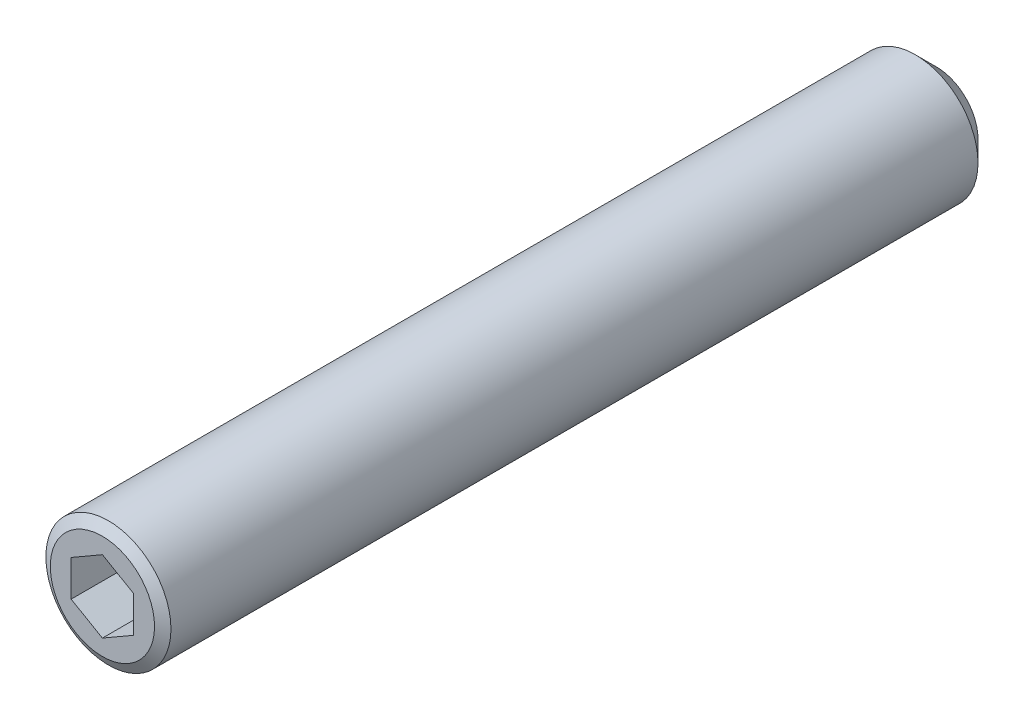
ISO-10303-21;
HEADER;
FILE_DESCRIPTION(('STEP AP214'),'2;1');
FILE_NAME('part.step','',(''),(''),'','','');
FILE_SCHEMA(('AUTOMOTIVE_DESIGN { 1 0 10303 214 1 1 1 1 }'));
ENDSEC;
DATA;
#1=APPLICATION_CONTEXT('core data for automotive mechanical design processes');
#2=APPLICATION_PROTOCOL_DEFINITION('international standard','automotive_design',2000,#1);
#3=PRODUCT_CONTEXT('',#1,'mechanical');
#4=PRODUCT('Part','Part','',(#3));
#5=PRODUCT_RELATED_PRODUCT_CATEGORY('part','',(#4));
#6=PRODUCT_DEFINITION_FORMATION('','',#4);
#7=PRODUCT_DEFINITION_CONTEXT('part definition',#1,'design');
#8=PRODUCT_DEFINITION('design','',#6,#7);
#9=PRODUCT_DEFINITION_SHAPE('','',#8);
#10=(LENGTH_UNIT() NAMED_UNIT(*) SI_UNIT(.MILLI.,.METRE.));
#11=(NAMED_UNIT(*) PLANE_ANGLE_UNIT() SI_UNIT($,.RADIAN.));
#12=(NAMED_UNIT(*) SI_UNIT($,.STERADIAN.) SOLID_ANGLE_UNIT());
#13=UNCERTAINTY_MEASURE_WITH_UNIT(LENGTH_MEASURE(1.E-05),#10,'distance_accuracy_value','');
#14=(GEOMETRIC_REPRESENTATION_CONTEXT(3) GLOBAL_UNCERTAINTY_ASSIGNED_CONTEXT((#13)) GLOBAL_UNIT_ASSIGNED_CONTEXT((#10,
#11,#12)) REPRESENTATION_CONTEXT('',''));
#15=CARTESIAN_POINT('',(0.,0.,0.));
#16=DIRECTION('',(0.,0.,1.));
#17=DIRECTION('',(1.,0.,0.));
#18=AXIS2_PLACEMENT_3D('',#15,#16,#17);
#19=CARTESIAN_POINT('',(0.,0.,40.));
#20=DIRECTION('',(0.,0.,-1.));
#21=DIRECTION('',(-1.,0.,0.));
#22=AXIS2_PLACEMENT_3D('',#19,#20,#21);
#23=CYLINDRICAL_SURFACE('',#22,3.);
#24=CARTESIAN_POINT('',(0.,0.,39.7113248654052));
#25=DIRECTION('',(0.,0.,1.));
#26=DIRECTION('',(1.,0.,0.));
#27=AXIS2_PLACEMENT_3D('',#24,#25,#26);
#28=CIRCLE('',#27,3.);
#29=CARTESIAN_POINT('',(3.,0.,39.7113248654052));
#30=VERTEX_POINT('',#29);
#31=EDGE_CURVE('E9',#30,#30,#28,.F.);
#32=ORIENTED_EDGE('',*,*,#31,.T.);
#33=EDGE_LOOP('',(#32));
#34=FACE_BOUND('',#33,.T.);
#35=CARTESIAN_POINT('',(0.,0.,1.));
#36=DIRECTION('',(0.,0.,1.));
#37=DIRECTION('',(1.,0.,0.));
#38=AXIS2_PLACEMENT_3D('',#35,#36,#37);
#39=CIRCLE('',#38,3.);
#40=CARTESIAN_POINT('',(3.,0.,1.));
#41=VERTEX_POINT('',#40);
#42=EDGE_CURVE('E116',#41,#41,#39,.T.);
#43=ORIENTED_EDGE('',*,*,#42,.T.);
#44=EDGE_LOOP('',(#43));
#45=FACE_BOUND('',#44,.T.);
#46=ADVANCED_FACE('F14',(#34,#45),#23,.T.);
#47=CARTESIAN_POINT('',(0.,0.,40.));
#48=DIRECTION('',(0.,0.,1.));
#49=DIRECTION('',(1.,0.,0.));
#50=AXIS2_PLACEMENT_3D('',#47,#48,#49);
#51=PLANE('',#50);
#52=DIRECTION('',(-0.866025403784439,0.5,0.));
#53=VECTOR('',#52,1.);
#54=CARTESIAN_POINT('',(1.5,0.866025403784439,40.));
#55=LINE('',#54,#53);
#56=CARTESIAN_POINT('',(1.5,0.866025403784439,40.));
#57=VERTEX_POINT('',#56);
#58=CARTESIAN_POINT('',(0.,1.73205080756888,40.));
#59=VERTEX_POINT('',#58);
#60=EDGE_CURVE('E29',#57,#59,#55,.T.);
#61=ORIENTED_EDGE('',*,*,#60,.F.);
#62=DIRECTION('',(0.,1.,0.));
#63=VECTOR('',#62,1.);
#64=CARTESIAN_POINT('',(1.5,-0.866025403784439,40.));
#65=LINE('',#64,#63);
#66=CARTESIAN_POINT('',(1.5,-0.866025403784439,40.));
#67=VERTEX_POINT('',#66);
#68=EDGE_CURVE('E112',#67,#57,#65,.T.);
#69=ORIENTED_EDGE('',*,*,#68,.F.);
#70=DIRECTION('',(0.866025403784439,0.5,0.));
#71=VECTOR('',#70,1.);
#72=CARTESIAN_POINT('',(0.,-1.73205080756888,40.));
#73=LINE('',#72,#71);
#74=CARTESIAN_POINT('',(0.,-1.73205080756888,40.));
#75=VERTEX_POINT('',#74);
#76=EDGE_CURVE('E110',#75,#67,#73,.T.);
#77=ORIENTED_EDGE('',*,*,#76,.F.);
#78=DIRECTION('',(0.866025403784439,-0.5,0.));
#79=VECTOR('',#78,1.);
#80=CARTESIAN_POINT('',(-1.5,-0.866025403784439,40.));
#81=LINE('',#80,#79);
#82=CARTESIAN_POINT('',(-1.5,-0.866025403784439,40.));
#83=VERTEX_POINT('',#82);
#84=EDGE_CURVE('E77',#83,#75,#81,.T.);
#85=ORIENTED_EDGE('',*,*,#84,.F.);
#86=DIRECTION('',(0.,-1.,0.));
#87=VECTOR('',#86,1.);
#88=CARTESIAN_POINT('',(-1.5,0.866025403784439,40.));
#89=LINE('',#88,#87);
#90=CARTESIAN_POINT('',(-1.5,0.866025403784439,40.));
#91=VERTEX_POINT('',#90);
#92=EDGE_CURVE('E106',#91,#83,#89,.T.);
#93=ORIENTED_EDGE('',*,*,#92,.F.);
#94=DIRECTION('',(-0.866025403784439,-0.5,0.));
#95=VECTOR('',#94,1.);
#96=CARTESIAN_POINT('',(0.,1.73205080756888,40.));
#97=LINE('',#96,#95);
#98=EDGE_CURVE('E103',#59,#91,#97,.T.);
#99=ORIENTED_EDGE('',*,*,#98,.F.);
#100=EDGE_LOOP('',(#61,#69,#77,#85,#93,#99));
#101=FACE_BOUND('',#100,.T.);
#102=CARTESIAN_POINT('',(0.,0.,40.));
#103=DIRECTION('',(0.,0.,1.));
#104=DIRECTION('',(1.,0.,0.));
#105=AXIS2_PLACEMENT_3D('',#102,#103,#104);
#106=CIRCLE('',#105,2.5);
#107=CARTESIAN_POINT('',(2.5,0.,40.));
#108=VERTEX_POINT('',#107);
#109=EDGE_CURVE('E22',#108,#108,#106,.T.);
#110=ORIENTED_EDGE('',*,*,#109,.T.);
#111=EDGE_LOOP('',(#110));
#112=FACE_BOUND('',#111,.T.);
#113=ADVANCED_FACE('F129',(#101,#112),#51,.T.);
#114=CARTESIAN_POINT('',(0.,0.,0.));
#115=DIRECTION('',(0.,0.,1.));
#116=DIRECTION('',(1.,0.,0.));
#117=AXIS2_PLACEMENT_3D('',#114,#115,#116);
#118=PLANE('',#117);
#119=CARTESIAN_POINT('',(0.,0.,0.));
#120=DIRECTION('',(0.,0.,1.));
#121=DIRECTION('',(1.,0.,0.));
#122=AXIS2_PLACEMENT_3D('',#119,#120,#121);
#123=CIRCLE('',#122,2.);
#124=CARTESIAN_POINT('',(2.,0.,0.));
#125=VERTEX_POINT('',#124);
#126=EDGE_CURVE('E124',#125,#125,#123,.F.);
#127=ORIENTED_EDGE('',*,*,#126,.T.);
#128=EDGE_LOOP('',(#127));
#129=FACE_BOUND('',#128,.T.);
#130=ADVANCED_FACE('F143',(#129),#118,.F.);
#131=CARTESIAN_POINT('',(0.,0.,1.));
#132=DIRECTION('',(0.,0.,1.));
#133=DIRECTION('',(1.,0.,0.));
#134=AXIS2_PLACEMENT_3D('',#131,#132,#133);
#135=CONICAL_SURFACE('',#134,3.,0.785398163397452);
#136=ORIENTED_EDGE('',*,*,#126,.F.);
#137=EDGE_LOOP('',(#136));
#138=FACE_BOUND('',#137,.T.);
#139=ORIENTED_EDGE('',*,*,#42,.F.);
#140=EDGE_LOOP('',(#139));
#141=FACE_BOUND('',#140,.T.);
#142=ADVANCED_FACE('F133',(#138,#141),#135,.T.);
#143=CARTESIAN_POINT('',(0.,0.,40.));
#144=DIRECTION('',(0.,0.,-1.));
#145=DIRECTION('',(-1.,0.,0.));
#146=AXIS2_PLACEMENT_3D('',#143,#144,#145);
#147=CONICAL_SURFACE('',#146,2.5,1.04719755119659);
#148=ORIENTED_EDGE('',*,*,#31,.F.);
#149=EDGE_LOOP('',(#148));
#150=FACE_BOUND('',#149,.T.);
#151=ORIENTED_EDGE('',*,*,#109,.F.);
#152=EDGE_LOOP('',(#151));
#153=FACE_BOUND('',#152,.T.);
#154=ADVANCED_FACE('F16',(#150,#153),#147,.T.);
#155=CARTESIAN_POINT('',(1.5,0.866025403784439,36.5));
#156=DIRECTION('',(0.5,0.866025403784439,0.));
#157=DIRECTION('',(-0.866025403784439,0.5,0.));
#158=AXIS2_PLACEMENT_3D('',#155,#156,#157);
#159=PLANE('',#158);
#160=ORIENTED_EDGE('',*,*,#60,.T.);
#161=DIRECTION('',(0.,0.,1.));
#162=VECTOR('',#161,1.);
#163=CARTESIAN_POINT('',(0.,1.73205080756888,36.5));
#164=LINE('',#163,#162);
#165=CARTESIAN_POINT('',(0.,1.73205080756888,36.5));
#166=VERTEX_POINT('',#165);
#167=EDGE_CURVE('E59',#166,#59,#164,.T.);
#168=ORIENTED_EDGE('',*,*,#167,.F.);
#169=DIRECTION('',(-0.866025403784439,0.5,0.));
#170=VECTOR('',#169,1.);
#171=CARTESIAN_POINT('',(1.5,0.866025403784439,36.5));
#172=LINE('',#171,#170);
#173=CARTESIAN_POINT('',(1.5,0.866025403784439,36.5));
#174=VERTEX_POINT('',#173);
#175=EDGE_CURVE('E114',#174,#166,#172,.T.);
#176=ORIENTED_EDGE('',*,*,#175,.F.);
#177=DIRECTION('',(0.,0.,1.));
#178=VECTOR('',#177,1.);
#179=CARTESIAN_POINT('',(1.5,0.866025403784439,36.5));
#180=LINE('',#179,#178);
#181=EDGE_CURVE('E37',#174,#57,#180,.T.);
#182=ORIENTED_EDGE('',*,*,#181,.T.);
#183=EDGE_LOOP('',(#160,#168,#176,#182));
#184=FACE_BOUND('',#183,.T.);
#185=ADVANCED_FACE('F132',(#184),#159,.F.);
#186=CARTESIAN_POINT('',(1.5,-0.866025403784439,36.5));
#187=DIRECTION('',(1.,0.,0.));
#188=DIRECTION('',(0.,0.,-1.));
#189=AXIS2_PLACEMENT_3D('',#186,#187,#188);
#190=PLANE('',#189);
#191=ORIENTED_EDGE('',*,*,#68,.T.);
#192=ORIENTED_EDGE('',*,*,#181,.F.);
#193=DIRECTION('',(0.,1.,0.));
#194=VECTOR('',#193,1.);
#195=CARTESIAN_POINT('',(1.5,-0.866025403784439,36.5));
#196=LINE('',#195,#194);
#197=CARTESIAN_POINT('',(1.5,-0.866025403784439,36.5));
#198=VERTEX_POINT('',#197);
#199=EDGE_CURVE('E89',#198,#174,#196,.T.);
#200=ORIENTED_EDGE('',*,*,#199,.F.);
#201=DIRECTION('',(0.,0.,1.));
#202=VECTOR('',#201,1.);
#203=CARTESIAN_POINT('',(1.5,-0.866025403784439,36.5));
#204=LINE('',#203,#202);
#205=EDGE_CURVE('E81',#198,#67,#204,.T.);
#206=ORIENTED_EDGE('',*,*,#205,.T.);
#207=EDGE_LOOP('',(#191,#192,#200,#206));
#208=FACE_BOUND('',#207,.T.);
#209=ADVANCED_FACE('F141',(#208),#190,.F.);
#210=CARTESIAN_POINT('',(0.,-1.73205080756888,36.5));
#211=DIRECTION('',(0.5,-0.866025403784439,0.));
#212=DIRECTION('',(0.866025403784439,0.5,0.));
#213=AXIS2_PLACEMENT_3D('',#210,#211,#212);
#214=PLANE('',#213);
#215=ORIENTED_EDGE('',*,*,#76,.T.);
#216=ORIENTED_EDGE('',*,*,#205,.F.);
#217=DIRECTION('',(0.866025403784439,0.5,0.));
#218=VECTOR('',#217,1.);
#219=CARTESIAN_POINT('',(0.,-1.73205080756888,36.5));
#220=LINE('',#219,#218);
#221=CARTESIAN_POINT('',(0.,-1.73205080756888,36.5));
#222=VERTEX_POINT('',#221);
#223=EDGE_CURVE('E85',#222,#198,#220,.T.);
#224=ORIENTED_EDGE('',*,*,#223,.F.);
#225=DIRECTION('',(0.,0.,1.));
#226=VECTOR('',#225,1.);
#227=CARTESIAN_POINT('',(0.,-1.73205080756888,36.5));
#228=LINE('',#227,#226);
#229=EDGE_CURVE('E70',#222,#75,#228,.T.);
#230=ORIENTED_EDGE('',*,*,#229,.T.);
#231=EDGE_LOOP('',(#215,#216,#224,#230));
#232=FACE_BOUND('',#231,.T.);
#233=ADVANCED_FACE('F86',(#232),#214,.F.);
#234=CARTESIAN_POINT('',(-1.5,-0.866025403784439,36.5));
#235=DIRECTION('',(-0.5,-0.866025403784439,0.));
#236=DIRECTION('',(0.866025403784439,-0.5,0.));
#237=AXIS2_PLACEMENT_3D('',#234,#235,#236);
#238=PLANE('',#237);
#239=ORIENTED_EDGE('',*,*,#84,.T.);
#240=ORIENTED_EDGE('',*,*,#229,.F.);
#241=DIRECTION('',(0.866025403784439,-0.5,0.));
#242=VECTOR('',#241,1.);
#243=CARTESIAN_POINT('',(-1.5,-0.866025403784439,36.5));
#244=LINE('',#243,#242);
#245=CARTESIAN_POINT('',(-1.5,-0.866025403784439,36.5));
#246=VERTEX_POINT('',#245);
#247=EDGE_CURVE('E74',#246,#222,#244,.T.);
#248=ORIENTED_EDGE('',*,*,#247,.F.);
#249=DIRECTION('',(0.,0.,1.));
#250=VECTOR('',#249,1.);
#251=CARTESIAN_POINT('',(-1.5,-0.866025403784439,36.5));
#252=LINE('',#251,#250);
#253=EDGE_CURVE('E82',#246,#83,#252,.T.);
#254=ORIENTED_EDGE('',*,*,#253,.T.);
#255=EDGE_LOOP('',(#239,#240,#248,#254));
#256=FACE_BOUND('',#255,.T.);
#257=ADVANCED_FACE('F72',(#256),#238,.F.);
#258=CARTESIAN_POINT('',(-1.5,0.866025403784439,36.5));
#259=DIRECTION('',(-1.,0.,0.));
#260=DIRECTION('',(0.,0.,1.));
#261=AXIS2_PLACEMENT_3D('',#258,#259,#260);
#262=PLANE('',#261);
#263=ORIENTED_EDGE('',*,*,#92,.T.);
#264=ORIENTED_EDGE('',*,*,#253,.F.);
#265=DIRECTION('',(0.,-1.,0.));
#266=VECTOR('',#265,1.);
#267=CARTESIAN_POINT('',(-1.5,0.866025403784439,36.5));
#268=LINE('',#267,#266);
#269=CARTESIAN_POINT('',(-1.5,0.866025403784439,36.5));
#270=VERTEX_POINT('',#269);
#271=EDGE_CURVE('E95',#270,#246,#268,.T.);
#272=ORIENTED_EDGE('',*,*,#271,.F.);
#273=DIRECTION('',(0.,0.,1.));
#274=VECTOR('',#273,1.);
#275=CARTESIAN_POINT('',(-1.5,0.866025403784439,36.5));
#276=LINE('',#275,#274);
#277=EDGE_CURVE('E119',#270,#91,#276,.T.);
#278=ORIENTED_EDGE('',*,*,#277,.T.);
#279=EDGE_LOOP('',(#263,#264,#272,#278));
#280=FACE_BOUND('',#279,.T.);
#281=ADVANCED_FACE('F163',(#280),#262,.F.);
#282=CARTESIAN_POINT('',(0.,1.73205080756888,36.5));
#283=DIRECTION('',(-0.5,0.866025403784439,0.));
#284=DIRECTION('',(-0.866025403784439,-0.5,0.));
#285=AXIS2_PLACEMENT_3D('',#282,#283,#284);
#286=PLANE('',#285);
#287=ORIENTED_EDGE('',*,*,#98,.T.);
#288=ORIENTED_EDGE('',*,*,#277,.F.);
#289=DIRECTION('',(-0.866025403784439,-0.5,0.));
#290=VECTOR('',#289,1.);
#291=CARTESIAN_POINT('',(0.,1.73205080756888,36.5));
#292=LINE('',#291,#290);
#293=EDGE_CURVE('E97',#166,#270,#292,.T.);
#294=ORIENTED_EDGE('',*,*,#293,.F.);
#295=ORIENTED_EDGE('',*,*,#167,.T.);
#296=EDGE_LOOP('',(#287,#288,#294,#295));
#297=FACE_BOUND('',#296,.T.);
#298=ADVANCED_FACE('F160',(#297),#286,.F.);
#299=CARTESIAN_POINT('',(0.,1.73205080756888,36.5));
#300=DIRECTION('',(0.,0.,1.));
#301=DIRECTION('',(1.,0.,0.));
#302=AXIS2_PLACEMENT_3D('',#299,#300,#301);
#303=PLANE('',#302);
#304=ORIENTED_EDGE('',*,*,#175,.T.);
#305=ORIENTED_EDGE('',*,*,#293,.T.);
#306=ORIENTED_EDGE('',*,*,#271,.T.);
#307=ORIENTED_EDGE('',*,*,#247,.T.);
#308=ORIENTED_EDGE('',*,*,#223,.T.);
#309=ORIENTED_EDGE('',*,*,#199,.T.);
#310=EDGE_LOOP('',(#304,#305,#306,#307,#308,#309));
#311=FACE_BOUND('',#310,.T.);
#312=ADVANCED_FACE('F92',(#311),#303,.T.);
#313=CLOSED_SHELL('',(#46,#113,#130,#142,#154,#185,#209,#233,#257,#281,#298,#312));
#314=MANIFOLD_SOLID_BREP('B1',#313);
#315=ADVANCED_BREP_SHAPE_REPRESENTATION('',(#18,#314),#14);
#316=SHAPE_DEFINITION_REPRESENTATION(#9,#315);
ENDSEC;
END-ISO-10303-21;
